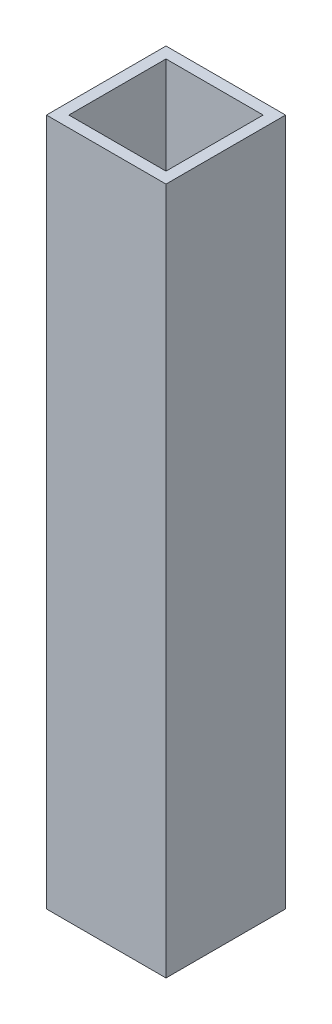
from build123d import *

# Parameters (mm, degrees)
SKETCH1_W           = 50.8
SKETCH1_H           = 50.8
SKETCH1_W_2         = 41.275
SKETCH1_H_2         = 41.275
BOSS_EXTRUDE1_DEPTH = 292.1


with BuildPart() as part:
    # Sketch1 → Boss-Extrude1 (new body)
    with BuildSketch(Plane(origin=(0, 146.05, 0), x_dir=(-1, 0, 0), z_dir=(0, 1, 0))):
        with Locations((0, 25.4)):
            Rectangle(SKETCH1_W, SKETCH1_H)
        with Locations((0, 25.4)):
            Rectangle(SKETCH1_W_2, SKETCH1_H_2, mode=Mode.SUBTRACT)
    extrude(amount=-BOSS_EXTRUDE1_DEPTH)


solid = part.part
